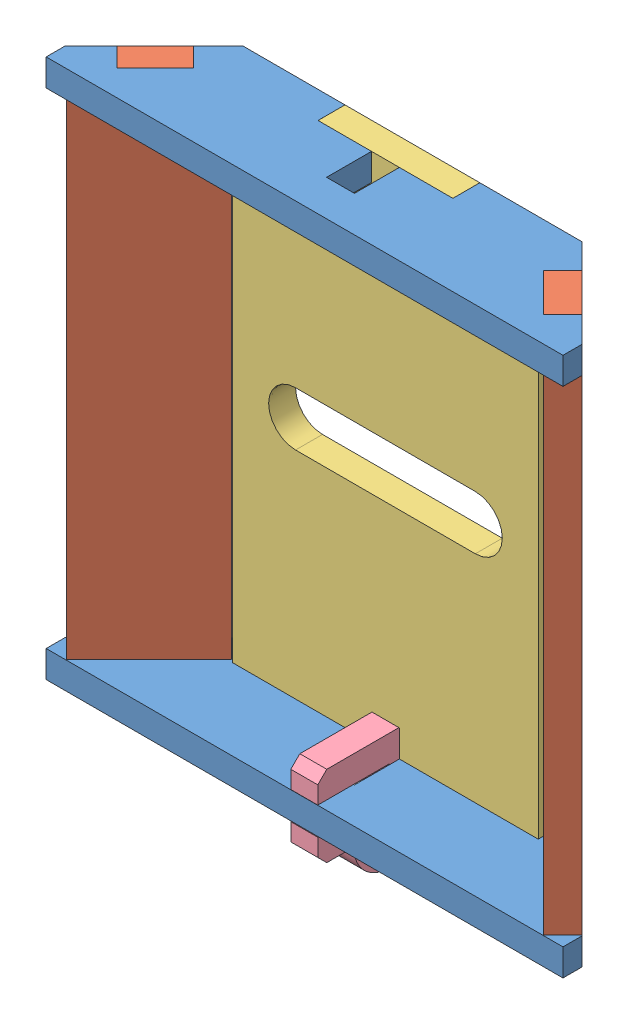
SolidWorks assembly Mount.SLDASM, configuration Default (file format 4700). Lengths in mm.
Overall size (57.5 67.05 12.02).
6 component instances, 4 part files, 10 mates.
Components (placement in the parent):
- mount_frontBack-1: mount_frontBack.SLDPRT [Default] at (-5.7308 -0.2198 2.1543) size (57.5 3 12)
- mount_side-1: mount_side.SLDPRT [Default] at (-29.8134 29.7802 1.3869) x (0 1 0) z (0.707107 0 -0.707107) size (60 3 13)
- mount_side-3: mount_side.SLDPRT [Default] at (18.3518 29.7802 1.3869) x (0 -1 0) z (-0.707107 0 -0.707107) size (60 3 13)
- mount_frontBack-3: mount_frontBack.SLDPRT [Default] at (-5.7308 59.7802 2.1543) x (-1 0 0) z (0 0 1) size (57.5 3 12)
- mount_top-1: mount_top.SLDPRT [Default] at (-5.7308 29.7802 -0.8457) x (1 0 0) z (0 1 0) size (34 3 60)
- mount_pin-1: mount_pin.SLDPRT [Default] at (-4.2808 1.2302 2.1331) x (0 1 0) z (0 0 1) size (13 3 12)
Mates (geometry in assembly coordinates):
- Coincident1: coincident aligned: plane of mount_frontBack-1 through (-5.7308 -0.2198 -22.6957) normal (0 -1 0); plane of mount_side-1 through (-29.4598 -0.2198 5.276) normal (0 -1 0)
- Coincident4: coincident anti-aligned: plane of mount_frontBack-1 through (-29.4598 2.7802 5.276) normal (-0.707107 0 -0.707107); plane of mount_side-1 through (-23.0959 56.7802 -1.088) normal (0.707107 0 0.707107)
- Coincident5: coincident anti-aligned: plane of mount_frontBack-1 through (-27.3385 2.7802 -1.088) normal (-0.707107 0 0.707107); plane of mount_side-1 through (-25.2172 -0.2198 1.0333) normal (0.707107 0 -0.707107)
- Coincident6: coincident aligned: plane of mount_frontBack-1 through (-24.5808 2.7802 -3.8457) normal (0 0 -1); plane of mount_top-1 through (11.2692 56.7802 -3.8457) normal (0 0 -1)
- Coincident7: coincident aligned: plane of mount_frontBack-1 through (-5.7308 -0.2198 -22.6957) normal (0 -1 0); plane of mount_top-1 through (-13.2308 -0.2198 -3.8457) normal (0 -1 0)
- Parallel1: parallel aligned: plane of mount_top-1 through (11.2692 56.7802 -3.8457) normal (0 0 -1); plane of mount_pin-1 through (-7.2808 -3.2698 -3.8669) normal (0 0 -1)
- Parallel2: parallel aligned: plane of mount_pin-1 through (-4.2808 5.7302 -3.8669) normal (1 0 0); plane of assembly through (0 0 0) normal (1 0 0)
- Coincident11: coincident anti-aligned: plane of mount_top-1 through (-7.2808 5.7802 -10.8457) normal (1 0 0); plane of mount_pin-1 through (-7.2808 5.7302 -3.8669) normal (-1 0 0)
- Coincident12: coincident anti-aligned: plane of mount_frontBack-1 through (-5.7308 2.7802 -22.6957) normal (0 1 0); plane of mount_pin-1 through (-7.2808 2.7802 0.1331) normal (0 -1 0)
- Coincident13: coincident anti-aligned: plane of mount_frontBack-1 through (1.7692 2.7802 -0.8457) normal (-1 0 0); plane of mount_top-1 through (1.7692 -0.2198 -3.8457) normal (1 0 0)
